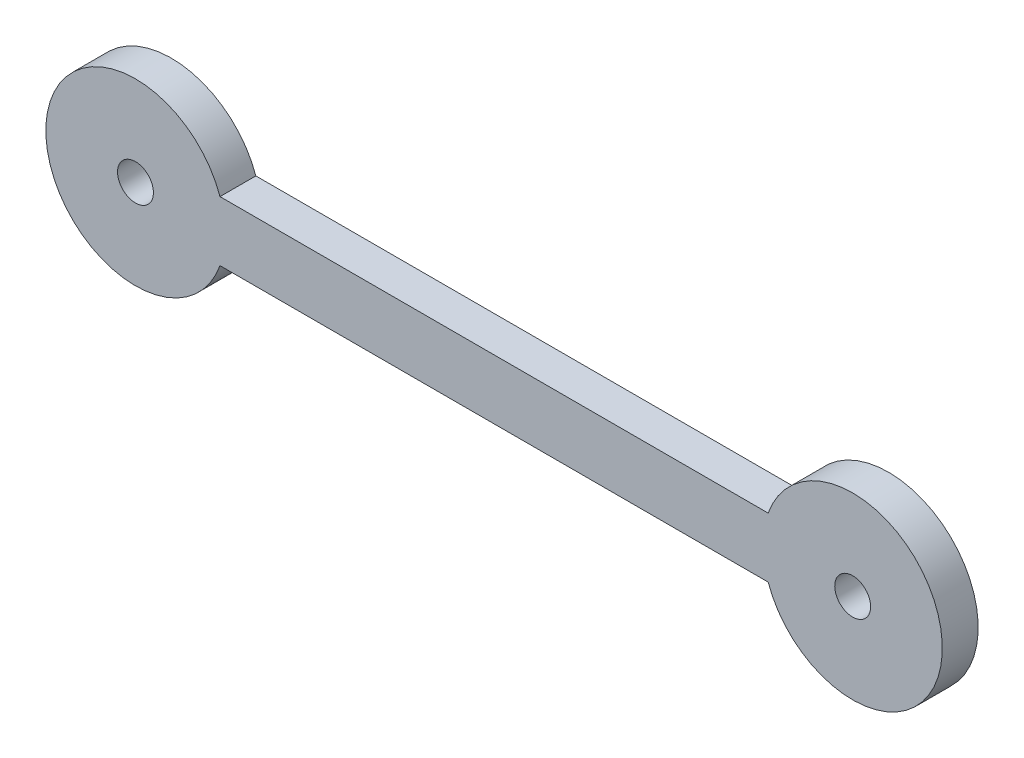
ISO-10303-21;
HEADER;
FILE_DESCRIPTION(('STEP AP214'),'2;1');
FILE_NAME('part.step','',(''),(''),'','','');
FILE_SCHEMA(('AUTOMOTIVE_DESIGN { 1 0 10303 214 1 1 1 1 }'));
ENDSEC;
DATA;
#1=APPLICATION_CONTEXT('core data for automotive mechanical design processes');
#2=APPLICATION_PROTOCOL_DEFINITION('international standard','automotive_design',2000,#1);
#3=PRODUCT_CONTEXT('',#1,'mechanical');
#4=PRODUCT('Part','Part','',(#3));
#5=PRODUCT_RELATED_PRODUCT_CATEGORY('part','',(#4));
#6=PRODUCT_DEFINITION_FORMATION('','',#4);
#7=PRODUCT_DEFINITION_CONTEXT('part definition',#1,'design');
#8=PRODUCT_DEFINITION('design','',#6,#7);
#9=PRODUCT_DEFINITION_SHAPE('','',#8);
#10=(LENGTH_UNIT() NAMED_UNIT(*) SI_UNIT(.MILLI.,.METRE.));
#11=(NAMED_UNIT(*) PLANE_ANGLE_UNIT() SI_UNIT($,.RADIAN.));
#12=(NAMED_UNIT(*) SI_UNIT($,.STERADIAN.) SOLID_ANGLE_UNIT());
#13=UNCERTAINTY_MEASURE_WITH_UNIT(LENGTH_MEASURE(1.E-05),#10,'distance_accuracy_value','');
#14=(GEOMETRIC_REPRESENTATION_CONTEXT(3) GLOBAL_UNCERTAINTY_ASSIGNED_CONTEXT((#13)) GLOBAL_UNIT_ASSIGNED_CONTEXT((#10,
#11,#12)) REPRESENTATION_CONTEXT('',''));
#15=CARTESIAN_POINT('',(0.,0.,0.));
#16=DIRECTION('',(0.,0.,1.));
#17=DIRECTION('',(1.,0.,0.));
#18=AXIS2_PLACEMENT_3D('',#15,#16,#17);
#19=CARTESIAN_POINT('',(120.,0.,6.));
#20=DIRECTION('',(0.,0.,-1.));
#21=DIRECTION('',(-1.,0.,0.));
#22=AXIS2_PLACEMENT_3D('',#19,#20,#21);
#23=PLANE('',#22);
#24=CARTESIAN_POINT('',(0.,0.,6.));
#25=DIRECTION('',(0.,0.,1.));
#26=DIRECTION('',(1.,0.,0.));
#27=AXIS2_PLACEMENT_3D('',#24,#25,#26);
#28=CIRCLE('',#27,3.);
#29=CARTESIAN_POINT('',(3.,0.,6.));
#30=VERTEX_POINT('',#29);
#31=EDGE_CURVE('E90',#30,#30,#28,.T.);
#32=ORIENTED_EDGE('',*,*,#31,.F.);
#33=EDGE_LOOP('',(#32));
#34=FACE_BOUND('',#33,.T.);
#35=CARTESIAN_POINT('',(120.,0.,6.));
#36=DIRECTION('',(0.,0.,1.));
#37=DIRECTION('',(-1.,0.,0.));
#38=AXIS2_PLACEMENT_3D('',#35,#36,#37);
#39=CIRCLE('',#38,15.);
#40=CARTESIAN_POINT('',(105.857864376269,-5.,6.));
#41=VERTEX_POINT('',#40);
#42=CARTESIAN_POINT('',(105.857864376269,5.00000000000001,6.));
#43=VERTEX_POINT('',#42);
#44=EDGE_CURVE('E100',#41,#43,#39,.T.);
#45=ORIENTED_EDGE('',*,*,#44,.T.);
#46=DIRECTION('',(-1.,0.,0.));
#47=VECTOR('',#46,1.);
#48=CARTESIAN_POINT('',(14.142135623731,5.,6.));
#49=LINE('',#48,#47);
#50=CARTESIAN_POINT('',(14.142135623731,5.,6.));
#51=VERTEX_POINT('',#50);
#52=EDGE_CURVE('E85',#43,#51,#49,.T.);
#53=ORIENTED_EDGE('',*,*,#52,.T.);
#54=CARTESIAN_POINT('',(0.,0.,6.));
#55=DIRECTION('',(0.,0.,1.));
#56=DIRECTION('',(1.,0.,0.));
#57=AXIS2_PLACEMENT_3D('',#54,#55,#56);
#58=CIRCLE('',#57,15.);
#59=CARTESIAN_POINT('',(14.1421356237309,-5.00000000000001,6.));
#60=VERTEX_POINT('',#59);
#61=EDGE_CURVE('E51',#51,#60,#58,.T.);
#62=ORIENTED_EDGE('',*,*,#61,.T.);
#63=DIRECTION('',(1.,0.,0.));
#64=VECTOR('',#63,1.);
#65=CARTESIAN_POINT('',(105.857864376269,-5.,6.));
#66=LINE('',#65,#64);
#67=EDGE_CURVE('E46',#60,#41,#66,.T.);
#68=ORIENTED_EDGE('',*,*,#67,.T.);
#69=EDGE_LOOP('',(#45,#53,#62,#68));
#70=FACE_BOUND('',#69,.T.);
#71=CARTESIAN_POINT('',(120.,0.,6.));
#72=DIRECTION('',(0.,0.,1.));
#73=DIRECTION('',(-1.,0.,0.));
#74=AXIS2_PLACEMENT_3D('',#71,#72,#73);
#75=CIRCLE('',#74,3.00000000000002);
#76=CARTESIAN_POINT('',(117.,0.,6.));
#77=VERTEX_POINT('',#76);
#78=EDGE_CURVE('E118',#77,#77,#75,.T.);
#79=ORIENTED_EDGE('',*,*,#78,.F.);
#80=EDGE_LOOP('',(#79));
#81=FACE_BOUND('',#80,.T.);
#82=ADVANCED_FACE('F31',(#34,#70,#81),#23,.F.);
#83=CARTESIAN_POINT('',(120.,0.,0.));
#84=DIRECTION('',(0.,0.,-1.));
#85=DIRECTION('',(-1.,0.,0.));
#86=AXIS2_PLACEMENT_3D('',#83,#84,#85);
#87=PLANE('',#86);
#88=CARTESIAN_POINT('',(0.,0.,0.));
#89=DIRECTION('',(0.,0.,1.));
#90=DIRECTION('',(1.,0.,0.));
#91=AXIS2_PLACEMENT_3D('',#88,#89,#90);
#92=CIRCLE('',#91,3.);
#93=CARTESIAN_POINT('',(3.,0.,0.));
#94=VERTEX_POINT('',#93);
#95=EDGE_CURVE('E93',#94,#94,#92,.T.);
#96=ORIENTED_EDGE('',*,*,#95,.T.);
#97=EDGE_LOOP('',(#96));
#98=FACE_BOUND('',#97,.T.);
#99=CARTESIAN_POINT('',(120.,0.,0.));
#100=DIRECTION('',(0.,0.,1.));
#101=DIRECTION('',(-1.,0.,0.));
#102=AXIS2_PLACEMENT_3D('',#99,#100,#101);
#103=CIRCLE('',#102,15.);
#104=CARTESIAN_POINT('',(105.857864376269,-5.,0.));
#105=VERTEX_POINT('',#104);
#106=CARTESIAN_POINT('',(105.857864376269,5.00000000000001,0.));
#107=VERTEX_POINT('',#106);
#108=EDGE_CURVE('E77',#105,#107,#103,.T.);
#109=ORIENTED_EDGE('',*,*,#108,.F.);
#110=DIRECTION('',(1.,0.,0.));
#111=VECTOR('',#110,1.);
#112=CARTESIAN_POINT('',(105.857864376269,-5.,0.));
#113=LINE('',#112,#111);
#114=CARTESIAN_POINT('',(14.1421356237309,-5.00000000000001,0.));
#115=VERTEX_POINT('',#114);
#116=EDGE_CURVE('E98',#115,#105,#113,.T.);
#117=ORIENTED_EDGE('',*,*,#116,.F.);
#118=CARTESIAN_POINT('',(0.,0.,0.));
#119=DIRECTION('',(0.,0.,1.));
#120=DIRECTION('',(1.,0.,0.));
#121=AXIS2_PLACEMENT_3D('',#118,#119,#120);
#122=CIRCLE('',#121,15.);
#123=CARTESIAN_POINT('',(14.142135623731,5.,0.));
#124=VERTEX_POINT('',#123);
#125=EDGE_CURVE('E78',#124,#115,#122,.T.);
#126=ORIENTED_EDGE('',*,*,#125,.F.);
#127=DIRECTION('',(-1.,0.,0.));
#128=VECTOR('',#127,1.);
#129=CARTESIAN_POINT('',(14.142135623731,5.,0.));
#130=LINE('',#129,#128);
#131=EDGE_CURVE('E72',#107,#124,#130,.T.);
#132=ORIENTED_EDGE('',*,*,#131,.F.);
#133=EDGE_LOOP('',(#109,#117,#126,#132));
#134=FACE_BOUND('',#133,.T.);
#135=CARTESIAN_POINT('',(120.,0.,0.));
#136=DIRECTION('',(0.,0.,1.));
#137=DIRECTION('',(-1.,0.,0.));
#138=AXIS2_PLACEMENT_3D('',#135,#136,#137);
#139=CIRCLE('',#138,3.00000000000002);
#140=CARTESIAN_POINT('',(117.,0.,0.));
#141=VERTEX_POINT('',#140);
#142=EDGE_CURVE('E120',#141,#141,#139,.T.);
#143=ORIENTED_EDGE('',*,*,#142,.T.);
#144=EDGE_LOOP('',(#143));
#145=FACE_BOUND('',#144,.T.);
#146=ADVANCED_FACE('F73',(#98,#134,#145),#87,.T.);
#147=CARTESIAN_POINT('',(120.,0.,6.));
#148=DIRECTION('',(0.,0.,-1.));
#149=DIRECTION('',(-1.,0.,0.));
#150=AXIS2_PLACEMENT_3D('',#147,#148,#149);
#151=CYLINDRICAL_SURFACE('',#150,15.);
#152=ORIENTED_EDGE('',*,*,#108,.T.);
#153=DIRECTION('',(0.,0.,-1.));
#154=VECTOR('',#153,1.);
#155=CARTESIAN_POINT('',(105.857864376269,5.00000000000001,6.));
#156=LINE('',#155,#154);
#157=EDGE_CURVE('E11',#43,#107,#156,.T.);
#158=ORIENTED_EDGE('',*,*,#157,.F.);
#159=ORIENTED_EDGE('',*,*,#44,.F.);
#160=DIRECTION('',(0.,0.,-1.));
#161=VECTOR('',#160,1.);
#162=CARTESIAN_POINT('',(105.857864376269,-5.,6.));
#163=LINE('',#162,#161);
#164=EDGE_CURVE('E89',#41,#105,#163,.T.);
#165=ORIENTED_EDGE('',*,*,#164,.T.);
#166=EDGE_LOOP('',(#152,#158,#159,#165));
#167=FACE_BOUND('',#166,.T.);
#168=ADVANCED_FACE('F33',(#167),#151,.T.);
#169=CARTESIAN_POINT('',(14.142135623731,5.,6.));
#170=DIRECTION('',(0.,-1.,0.));
#171=DIRECTION('',(1.,0.,0.));
#172=AXIS2_PLACEMENT_3D('',#169,#170,#171);
#173=PLANE('',#172);
#174=ORIENTED_EDGE('',*,*,#131,.T.);
#175=DIRECTION('',(0.,0.,-1.));
#176=VECTOR('',#175,1.);
#177=CARTESIAN_POINT('',(14.142135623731,5.,6.));
#178=LINE('',#177,#176);
#179=EDGE_CURVE('E39',#51,#124,#178,.T.);
#180=ORIENTED_EDGE('',*,*,#179,.F.);
#181=ORIENTED_EDGE('',*,*,#52,.F.);
#182=ORIENTED_EDGE('',*,*,#157,.T.);
#183=EDGE_LOOP('',(#174,#180,#181,#182));
#184=FACE_BOUND('',#183,.T.);
#185=ADVANCED_FACE('F84',(#184),#173,.F.);
#186=CARTESIAN_POINT('',(0.,0.,6.));
#187=DIRECTION('',(0.,0.,-1.));
#188=DIRECTION('',(-1.,0.,0.));
#189=AXIS2_PLACEMENT_3D('',#186,#187,#188);
#190=CYLINDRICAL_SURFACE('',#189,15.);
#191=ORIENTED_EDGE('',*,*,#125,.T.);
#192=DIRECTION('',(0.,0.,-1.));
#193=VECTOR('',#192,1.);
#194=CARTESIAN_POINT('',(14.1421356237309,-5.00000000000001,6.));
#195=LINE('',#194,#193);
#196=EDGE_CURVE('E106',#60,#115,#195,.T.);
#197=ORIENTED_EDGE('',*,*,#196,.F.);
#198=ORIENTED_EDGE('',*,*,#61,.F.);
#199=ORIENTED_EDGE('',*,*,#179,.T.);
#200=EDGE_LOOP('',(#191,#197,#198,#199));
#201=FACE_BOUND('',#200,.T.);
#202=ADVANCED_FACE('F109',(#201),#190,.T.);
#203=CARTESIAN_POINT('',(105.857864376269,-5.,6.));
#204=DIRECTION('',(0.,1.,0.));
#205=DIRECTION('',(-1.,0.,0.));
#206=AXIS2_PLACEMENT_3D('',#203,#204,#205);
#207=PLANE('',#206);
#208=ORIENTED_EDGE('',*,*,#116,.T.);
#209=ORIENTED_EDGE('',*,*,#164,.F.);
#210=ORIENTED_EDGE('',*,*,#67,.F.);
#211=ORIENTED_EDGE('',*,*,#196,.T.);
#212=EDGE_LOOP('',(#208,#209,#210,#211));
#213=FACE_BOUND('',#212,.T.);
#214=ADVANCED_FACE('F111',(#213),#207,.F.);
#215=CARTESIAN_POINT('',(0.,0.,6.));
#216=DIRECTION('',(0.,0.,-1.));
#217=DIRECTION('',(-1.,0.,0.));
#218=AXIS2_PLACEMENT_3D('',#215,#216,#217);
#219=CYLINDRICAL_SURFACE('',#218,3.);
#220=ORIENTED_EDGE('',*,*,#31,.T.);
#221=EDGE_LOOP('',(#220));
#222=FACE_BOUND('',#221,.T.);
#223=ORIENTED_EDGE('',*,*,#95,.F.);
#224=EDGE_LOOP('',(#223));
#225=FACE_BOUND('',#224,.T.);
#226=ADVANCED_FACE('F129',(#222,#225),#219,.F.);
#227=CARTESIAN_POINT('',(120.,0.,6.));
#228=DIRECTION('',(0.,0.,-1.));
#229=DIRECTION('',(-1.,0.,0.));
#230=AXIS2_PLACEMENT_3D('',#227,#228,#229);
#231=CYLINDRICAL_SURFACE('',#230,3.00000000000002);
#232=ORIENTED_EDGE('',*,*,#78,.T.);
#233=EDGE_LOOP('',(#232));
#234=FACE_BOUND('',#233,.T.);
#235=ORIENTED_EDGE('',*,*,#142,.F.);
#236=EDGE_LOOP('',(#235));
#237=FACE_BOUND('',#236,.T.);
#238=ADVANCED_FACE('F127',(#234,#237),#231,.F.);
#239=CLOSED_SHELL('',(#82,#146,#168,#185,#202,#214,#226,#238));
#240=MANIFOLD_SOLID_BREP('B2',#239);
#241=ADVANCED_BREP_SHAPE_REPRESENTATION('',(#18,#240),#14);
#242=SHAPE_DEFINITION_REPRESENTATION(#9,#241);
ENDSEC;
END-ISO-10303-21;
